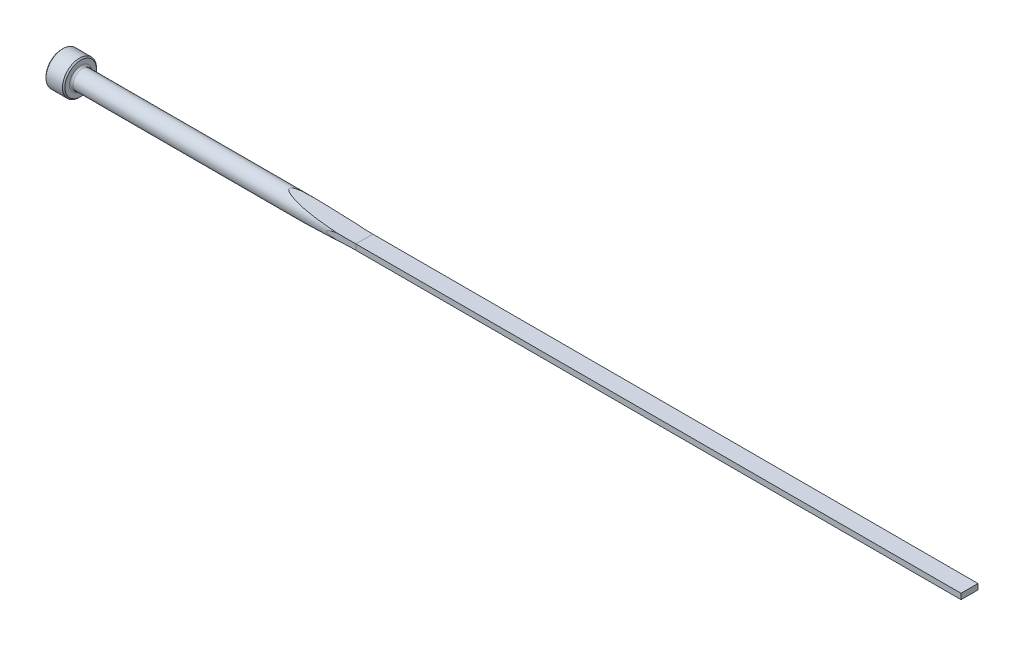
ISO-10303-21;
HEADER;
FILE_DESCRIPTION(('STEP AP214'),'2;1');
FILE_NAME('part.step','',(''),(''),'','','');
FILE_SCHEMA(('AUTOMOTIVE_DESIGN { 1 0 10303 214 1 1 1 1 }'));
ENDSEC;
DATA;
#1=APPLICATION_CONTEXT('core data for automotive mechanical design processes');
#2=APPLICATION_PROTOCOL_DEFINITION('international standard','automotive_design',2000,#1);
#3=PRODUCT_CONTEXT('',#1,'mechanical');
#4=PRODUCT('Part','Part','',(#3));
#5=PRODUCT_RELATED_PRODUCT_CATEGORY('part','',(#4));
#6=PRODUCT_DEFINITION_FORMATION('','',#4);
#7=PRODUCT_DEFINITION_CONTEXT('part definition',#1,'design');
#8=PRODUCT_DEFINITION('design','',#6,#7);
#9=PRODUCT_DEFINITION_SHAPE('','',#8);
#10=(LENGTH_UNIT() NAMED_UNIT(*) SI_UNIT(.MILLI.,.METRE.));
#11=(NAMED_UNIT(*) PLANE_ANGLE_UNIT() SI_UNIT($,.RADIAN.));
#12=(NAMED_UNIT(*) SI_UNIT($,.STERADIAN.) SOLID_ANGLE_UNIT());
#13=UNCERTAINTY_MEASURE_WITH_UNIT(LENGTH_MEASURE(1.E-05),#10,'distance_accuracy_value','');
#14=(GEOMETRIC_REPRESENTATION_CONTEXT(3) GLOBAL_UNCERTAINTY_ASSIGNED_CONTEXT((#13)) GLOBAL_UNIT_ASSIGNED_CONTEXT((#10,
#11,#12)) REPRESENTATION_CONTEXT('',''));
#15=CARTESIAN_POINT('',(0.,0.,0.));
#16=DIRECTION('',(0.,0.,1.));
#17=DIRECTION('',(1.,0.,0.));
#18=AXIS2_PLACEMENT_3D('',#15,#16,#17);
#19=CARTESIAN_POINT('',(0.,0.,0.));
#20=DIRECTION('',(-1.,0.,0.));
#21=DIRECTION('',(0.,0.,1.));
#22=AXIS2_PLACEMENT_3D('',#19,#20,#21);
#23=CYLINDRICAL_SURFACE('',#22,1.9812);
#24=CARTESIAN_POINT('',(4.3434,0.,0.));
#25=DIRECTION('',(-1.,0.,0.));
#26=DIRECTION('',(0.,0.,1.));
#27=AXIS2_PLACEMENT_3D('',#24,#25,#26);
#28=CIRCLE('',#27,1.9812);
#29=CARTESIAN_POINT('',(4.3434,0.,1.9812));
#30=VERTEX_POINT('',#29);
#31=EDGE_CURVE('E152',#30,#30,#28,.F.);
#32=ORIENTED_EDGE('',*,*,#31,.T.);
#33=EDGE_LOOP('',(#32));
#34=FACE_BOUND('',#33,.T.);
#35=CARTESIAN_POINT('',(63.5,0.873996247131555,1.77799999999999));
#36=CARTESIAN_POINT('',(63.3334542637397,0.873989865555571,1.77799993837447));
#37=CARTESIAN_POINT('',(63.1669097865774,0.873044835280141,1.77846802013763));
#38=CARTESIAN_POINT('',(62.8338428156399,0.869223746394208,1.780339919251));
#39=CARTESIAN_POINT('',(62.6673203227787,0.866347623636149,1.78174376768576));
#40=CARTESIAN_POINT('',(62.1674068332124,0.854732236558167,1.78736286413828));
#41=CARTESIAN_POINT('',(61.8340948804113,0.84300568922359,1.7929856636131));
#42=CARTESIAN_POINT('',(61.1727863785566,0.810634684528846,1.80785962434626));
#43=CARTESIAN_POINT('',(60.8447825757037,0.790121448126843,1.81705721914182));
#44=CARTESIAN_POINT('',(60.3536671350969,0.750641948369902,1.83354371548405));
#45=CARTESIAN_POINT('',(60.1901577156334,0.736036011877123,1.83948544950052));
#46=CARTESIAN_POINT('',(59.8635315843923,0.703289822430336,1.85225599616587));
#47=CARTESIAN_POINT('',(59.7004148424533,0.68514985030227,1.85908473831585));
#48=CARTESIAN_POINT('',(59.4296562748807,0.651228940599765,1.87116478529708));
#49=CARTESIAN_POINT('',(59.3218452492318,0.636713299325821,1.8761721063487));
#50=CARTESIAN_POINT('',(59.1065408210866,0.605233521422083,1.88656384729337));
#51=CARTESIAN_POINT('',(58.9990475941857,0.588268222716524,1.8919484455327));
#52=CARTESIAN_POINT('',(58.7835275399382,0.551010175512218,1.9031350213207));
#53=CARTESIAN_POINT('',(58.6755064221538,0.530685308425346,1.90894069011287));
#54=CARTESIAN_POINT('',(58.4604889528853,0.485692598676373,1.92088824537));
#55=CARTESIAN_POINT('',(58.3534914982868,0.461030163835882,1.92702970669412));
#56=CARTESIAN_POINT('',(58.1938896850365,0.418829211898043,1.93647603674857));
#57=CARTESIAN_POINT('',(58.1406123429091,0.403818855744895,1.93967803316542));
#58=CARTESIAN_POINT('',(58.0346066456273,0.371424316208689,1.94614386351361));
#59=CARTESIAN_POINT('',(57.9818801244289,0.354033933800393,1.94940783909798));
#60=CARTESIAN_POINT('',(57.8782386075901,0.31609459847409,1.95591437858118));
#61=CARTESIAN_POINT('',(57.8273101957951,0.295581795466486,1.95915679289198));
#62=CARTESIAN_POINT('',(57.7278405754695,0.249491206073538,1.9655736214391));
#63=CARTESIAN_POINT('',(57.6792877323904,0.223942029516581,1.96874831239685));
#64=CARTESIAN_POINT('',(57.6167619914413,0.181702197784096,1.97288277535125));
#65=CARTESIAN_POINT('',(57.5999648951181,0.16929724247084,1.97399869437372));
#66=CARTESIAN_POINT('',(57.5681376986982,0.142414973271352,1.97612145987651));
#67=CARTESIAN_POINT('',(57.5530993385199,0.12794811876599,1.97712881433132));
#68=CARTESIAN_POINT('',(57.5334076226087,0.104576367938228,1.97845199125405));
#69=CARTESIAN_POINT('',(57.5274666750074,0.0967736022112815,1.97885188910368));
#70=CARTESIAN_POINT('',(57.516621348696,0.0804504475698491,1.97958282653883));
#71=CARTESIAN_POINT('',(57.5117177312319,0.0719295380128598,1.9799138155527));
#72=CARTESIAN_POINT('',(57.5032905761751,0.0540450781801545,1.9804831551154));
#73=CARTESIAN_POINT('',(57.4997893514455,0.0446706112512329,1.98072000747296));
#74=CARTESIAN_POINT('',(57.4947628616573,0.0254116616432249,1.98106017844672));
#75=CARTESIAN_POINT('',(57.4932312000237,0.0155289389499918,1.98116392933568));
#76=CARTESIAN_POINT('',(57.4924621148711,-0.00283989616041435,1.98121601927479));
#77=CARTESIAN_POINT('',(57.4929156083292,-0.0113136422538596,1.98118529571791));
#78=CARTESIAN_POINT('',(57.4953671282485,-0.0280374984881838,1.98101929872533));
#79=CARTESIAN_POINT('',(57.4973672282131,-0.0362872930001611,1.98088388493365));
#80=CARTESIAN_POINT('',(57.5032599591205,-0.0541083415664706,1.98048527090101));
#81=CARTESIAN_POINT('',(57.5074720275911,-0.0635712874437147,1.98020051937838));
#82=CARTESIAN_POINT('',(57.5173271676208,-0.081709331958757,1.97953524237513));
#83=CARTESIAN_POINT('',(57.5229731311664,-0.0903827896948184,1.97915452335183));
#84=CARTESIAN_POINT('',(57.5399709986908,-0.113337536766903,1.97801031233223));
#85=CARTESIAN_POINT('',(57.5523792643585,-0.126821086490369,1.97717711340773));
#86=CARTESIAN_POINT('',(57.578895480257,-0.151968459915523,1.97540307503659));
#87=CARTESIAN_POINT('',(57.5930088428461,-0.163626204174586,1.97446189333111));
#88=CARTESIAN_POINT('',(57.6308983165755,-0.19208509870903,1.97194504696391));
#89=CARTESIAN_POINT('',(57.6554459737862,-0.207842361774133,1.97032379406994));
#90=CARTESIAN_POINT('',(57.7058684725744,-0.237095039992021,1.96701597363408));
#91=CARTESIAN_POINT('',(57.731746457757,-0.250584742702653,1.9653292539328));
#92=CARTESIAN_POINT('',(57.8107777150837,-0.288767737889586,1.96021411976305));
#93=CARTESIAN_POINT('',(57.8650936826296,-0.311024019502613,1.95674636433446));
#94=CARTESIAN_POINT('',(57.9833217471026,-0.354812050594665,1.94931073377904));
#95=CARTESIAN_POINT('',(58.0474477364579,-0.375730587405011,1.94534614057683));
#96=CARTESIAN_POINT('',(58.1766973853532,-0.41429027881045,1.93749827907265));
#97=CARTESIAN_POINT('',(58.2418214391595,-0.431930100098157,1.93361504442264));
#98=CARTESIAN_POINT('',(58.4383860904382,-0.481456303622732,1.92211396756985));
#99=CARTESIAN_POINT('',(58.5707045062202,-0.509845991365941,1.91466459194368));
#100=CARTESIAN_POINT('',(58.8364278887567,-0.560951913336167,1.90030665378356));
#101=CARTESIAN_POINT('',(58.9698330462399,-0.583667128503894,1.89339818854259));
#102=CARTESIAN_POINT('',(59.2371090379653,-0.624985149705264,1.88016424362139));
#103=CARTESIAN_POINT('',(59.3709789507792,-0.643593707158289,1.87383795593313));
#104=CARTESIAN_POINT('',(59.6612886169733,-0.680513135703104,1.86077894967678));
#105=CARTESIAN_POINT('',(59.8178028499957,-0.698266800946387,1.85415178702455));
#106=CARTESIAN_POINT('',(60.1312113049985,-0.730437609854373,1.84171312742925));
#107=CARTESIAN_POINT('',(60.2881055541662,-0.744854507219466,1.83590169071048));
#108=CARTESIAN_POINT('',(60.7593917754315,-0.784010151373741,1.81969752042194));
#109=CARTESIAN_POINT('',(61.074170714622,-0.804628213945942,1.81054467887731));
#110=CARTESIAN_POINT('',(61.703676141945,-0.837438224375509,1.79559337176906));
#111=CARTESIAN_POINT('',(62.0184017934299,-0.849644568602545,1.78978917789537));
#112=CARTESIAN_POINT('',(62.6480072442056,-0.866841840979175,1.78152544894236));
#113=CARTESIAN_POINT('',(62.962886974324,-0.871834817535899,1.77906496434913));
#114=CARTESIAN_POINT('',(63.3518520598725,-0.873806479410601,1.77809255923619));
#115=CARTESIAN_POINT('',(63.4259264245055,-0.873993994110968,1.77799996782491));
#116=CARTESIAN_POINT('',(63.5,-0.873996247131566,1.77799999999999));
#117=B_SPLINE_CURVE_WITH_KNOTS('',3,(#35,#36,#37,#38,#39,#40,#41,#42,#43,#44,#45,#46,#47,#48,
#49,#50,#51,#52,#53,#54,#55,#56,#57,#58,#59,#60,#61,#62,#63,#64,#65,#66,#67,#68,#69,#70,#71,#72,
#73,#74,#75,#76,#77,#78,#79,#80,#81,#82,#83,#84,#85,#86,#87,#88,#89,#90,#91,#92,#93,#94,#95,#96,
#97,#98,#99,#100,#101,#102,#103,#104,#105,#106,#107,#108,#109,#110,#111,#112,#113,#114,#115,
#116),.UNSPECIFIED.,.F.,.F.,(4,2,2,2,2,2,2,2,2,2,2,2,2,2,2,2,2,2,2,2,2,2,2,2,2,2,2,2,2,2,2,2,2,
2,2,2,2,2,2,2,4),(0.,0.499631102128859,0.999278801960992,1.9998489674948,2.98597077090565,
3.47874557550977,3.97148123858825,4.29815737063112,4.62498898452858,4.95514810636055,
5.28489848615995,5.4512016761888,5.61794656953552,5.78289019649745,5.9469225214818,
6.00956538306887,6.07190109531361,6.10128690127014,6.1306941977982,6.1605523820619,
6.1903133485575,6.21561974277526,6.24096012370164,6.27187252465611,6.30284777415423,
6.35756673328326,6.41246418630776,6.49988097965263,6.58751479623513,6.76361391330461,
6.96621737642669,7.16890304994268,7.57526706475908,7.98170400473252,8.38756806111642,
8.86049226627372,9.33345136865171,10.2800238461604,11.2249722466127,12.1696522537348,
12.3918748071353),.UNSPECIFIED.);
#118=CARTESIAN_POINT('',(59.5839311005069,0.670493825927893,1.86429382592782));
#119=VERTEX_POINT('',#118);
#120=CARTESIAN_POINT('',(59.583931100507,-0.67049382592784,1.86429382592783));
#121=VERTEX_POINT('',#120);
#122=EDGE_CURVE('E155',#119,#121,#117,.T.);
#123=ORIENTED_EDGE('',*,*,#122,.F.);
#124=CARTESIAN_POINT('',(63.5,0.584199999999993,1.89310955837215));
#125=CARTESIAN_POINT('',(63.1700863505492,0.584199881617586,1.89309681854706));
#126=CARTESIAN_POINT('',(62.8401724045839,0.58603649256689,1.89254233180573));
#127=CARTESIAN_POINT('',(62.1803800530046,0.593382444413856,1.89025884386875));
#128=CARTESIAN_POINT('',(61.8505016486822,0.598891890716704,1.88852980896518));
#129=CARTESIAN_POINT('',(61.190029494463,0.613600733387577,1.88380042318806));
#130=CARTESIAN_POINT('',(60.8594359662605,0.622809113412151,1.88079697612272));
#131=CARTESIAN_POINT('',(60.1983963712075,0.644913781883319,1.87333307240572));
#132=CARTESIAN_POINT('',(59.867950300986,0.657809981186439,1.86887265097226));
#133=CARTESIAN_POINT('',(59.206638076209,0.687314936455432,1.85822443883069));
#134=CARTESIAN_POINT('',(58.8757722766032,0.703930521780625,1.85203346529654));
#135=CARTESIAN_POINT('',(58.2142925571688,0.74085644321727,1.83757415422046));
#136=CARTESIAN_POINT('',(57.8836786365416,0.761166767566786,1.82930582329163));
#137=CARTESIAN_POINT('',(57.2226843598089,0.805481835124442,1.81023067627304));
#138=CARTESIAN_POINT('',(56.8923040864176,0.829487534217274,1.79942320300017));
#139=CARTESIAN_POINT('',(56.2319511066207,0.881180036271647,1.77468231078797));
#140=CARTESIAN_POINT('',(55.9019783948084,0.908866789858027,1.76074893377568));
#141=CARTESIAN_POINT('',(55.2431418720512,0.96785415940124,1.72902645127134));
#142=CARTESIAN_POINT('',(54.914277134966,0.999148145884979,1.7112443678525));
#143=CARTESIAN_POINT('',(54.2572138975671,1.06536758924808,1.67082431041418));
#144=CARTESIAN_POINT('',(53.9290153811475,1.10029295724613,1.64818645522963));
#145=CARTESIAN_POINT('',(53.2736403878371,1.17372354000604,1.5967269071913));
#146=CARTESIAN_POINT('',(52.9464635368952,1.21222723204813,1.56790783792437));
#147=CARTESIAN_POINT('',(52.2933682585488,1.29276273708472,1.50221251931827));
#148=CARTESIAN_POINT('',(51.967449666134,1.3347940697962,1.46533736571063));
#149=CARTESIAN_POINT('',(51.5099827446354,1.39636103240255,1.40567954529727));
#150=CARTESIAN_POINT('',(51.3776412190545,1.41447635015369,1.38748545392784));
#151=CARTESIAN_POINT('',(51.1133387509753,1.45126058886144,1.34896581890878));
#152=CARTESIAN_POINT('',(50.981377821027,1.46992952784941,1.328640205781));
#153=CARTESIAN_POINT('',(50.7178209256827,1.50781885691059,1.28548073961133));
#154=CARTESIAN_POINT('',(50.5862253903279,1.5270397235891,1.26264466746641));
#155=CARTESIAN_POINT('',(50.3236620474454,1.56598955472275,1.21400299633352));
#156=CARTESIAN_POINT('',(50.1926942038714,1.58571848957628,1.18819757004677));
#157=CARTESIAN_POINT('',(49.9607960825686,1.62117893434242,1.13913600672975));
#158=CARTESIAN_POINT('',(49.8596995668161,1.6368175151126,1.11660072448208));
#159=CARTESIAN_POINT('',(49.658165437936,1.66834712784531,1.0689199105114));
#160=CARTESIAN_POINT('',(49.5577277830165,1.68423814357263,1.0437745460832));
#161=CARTESIAN_POINT('',(49.3579115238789,1.71620155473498,0.990340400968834));
#162=CARTESIAN_POINT('',(49.2585313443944,1.73227357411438,0.962057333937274));
#163=CARTESIAN_POINT('',(49.0610345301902,1.76455408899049,0.901490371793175));
#164=CARTESIAN_POINT('',(48.9629175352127,1.78076254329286,0.869207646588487));
#165=CARTESIAN_POINT('',(48.7875328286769,1.81003279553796,0.806160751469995));
#166=CARTESIAN_POINT('',(48.7099334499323,1.82309131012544,0.776329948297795));
#167=CARTESIAN_POINT('',(48.5563786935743,1.84913700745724,0.712076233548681));
#168=CARTESIAN_POINT('',(48.4804283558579,1.86212389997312,0.677641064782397));
#169=CARTESIAN_POINT('',(48.3308241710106,1.88789942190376,0.602179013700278));
#170=CARTESIAN_POINT('',(48.2571964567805,1.90068529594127,0.561096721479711));
#171=CARTESIAN_POINT('',(48.1513685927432,1.91919096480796,0.492350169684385));
#172=CARTESIAN_POINT('',(48.1169057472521,1.92523948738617,0.468285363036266));
#173=CARTESIAN_POINT('',(48.0502753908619,1.93697192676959,0.417116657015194));
#174=CARTESIAN_POINT('',(48.0181042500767,1.94265641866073,0.390017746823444));
#175=CARTESIAN_POINT('',(47.9629838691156,1.95242426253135,0.337299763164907));
#176=CARTESIAN_POINT('',(47.9394311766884,1.95660898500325,0.312339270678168));
#177=CARTESIAN_POINT('',(47.8960045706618,1.96434049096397,0.259297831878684));
#178=CARTESIAN_POINT('',(47.8761211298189,1.9678889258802,0.231225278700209));
#179=CARTESIAN_POINT('',(47.847884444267,1.97293551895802,0.181839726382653));
#180=CARTESIAN_POINT('',(47.8379127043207,1.97471998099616,0.161493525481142));
#181=CARTESIAN_POINT('',(47.8212302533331,1.97770737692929,0.119454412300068));
#182=CARTESIAN_POINT('',(47.8145156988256,1.97891099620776,0.0977631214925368));
#183=CARTESIAN_POINT('',(47.805038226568,1.9806103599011,0.0532481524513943));
#184=CARTESIAN_POINT('',(47.8023158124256,1.98109884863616,0.0304152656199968));
#185=CARTESIAN_POINT('',(47.8013478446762,1.98127249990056,-0.0153468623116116));
#186=CARTESIAN_POINT('',(47.8031008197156,1.98095792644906,-0.0382760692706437));
#187=CARTESIAN_POINT('',(47.8103218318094,1.97966292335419,-0.080483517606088));
#188=CARTESIAN_POINT('',(47.8152881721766,1.97877241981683,-0.0998547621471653));
#189=CARTESIAN_POINT('',(47.8279513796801,1.97650357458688,-0.137643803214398));
#190=CARTESIAN_POINT('',(47.8356499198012,1.9751249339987,-0.156061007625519));
#191=CARTESIAN_POINT('',(47.8589604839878,1.97095473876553,-0.203392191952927));
#192=CARTESIAN_POINT('',(47.8764622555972,1.96782751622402,-0.231338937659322));
#193=CARTESIAN_POINT('',(47.9153978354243,1.96088554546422,-0.284245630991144));
#194=CARTESIAN_POINT('',(47.9368445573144,1.95706854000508,-0.30919531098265));
#195=CARTESIAN_POINT('',(48.0046826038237,1.94502473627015,-0.379909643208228));
#196=CARTESIAN_POINT('',(48.0548087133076,1.93616258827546,-0.421925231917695));
#197=CARTESIAN_POINT('',(48.1598403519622,1.91769727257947,-0.499149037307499));
#198=CARTESIAN_POINT('',(48.2147605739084,1.90809183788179,-0.534335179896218));
#199=CARTESIAN_POINT('',(48.3216449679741,1.88950738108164,-0.596534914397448));
#200=CARTESIAN_POINT('',(48.3733462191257,1.88056327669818,-0.62401516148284));
#201=CARTESIAN_POINT('',(48.4782240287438,1.86251839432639,-0.675966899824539));
#202=CARTESIAN_POINT('',(48.531401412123,1.85341752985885,-0.700436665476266));
#203=CARTESIAN_POINT('',(48.6926568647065,1.82597467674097,-0.770393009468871));
#204=CARTESIAN_POINT('',(48.8022561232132,1.80752762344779,-0.81231702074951));
#205=CARTESIAN_POINT('',(49.0242156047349,1.77060682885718,-0.889907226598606));
#206=CARTESIAN_POINT('',(49.1365872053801,1.7521334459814,-0.925539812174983));
#207=CARTESIAN_POINT('',(49.3626192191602,1.71542676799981,-0.991916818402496));
#208=CARTESIAN_POINT('',(49.476277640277,1.6971931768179,-1.02266791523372));
#209=CARTESIAN_POINT('',(49.7276664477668,1.65736960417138,-1.08625828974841));
#210=CARTESIAN_POINT('',(49.8656164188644,1.63584659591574,-1.11826213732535));
#211=CARTESIAN_POINT('',(50.1425123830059,1.59331791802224,-1.17806325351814));
#212=CARTESIAN_POINT('',(50.2814585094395,1.57231231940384,-1.205859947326));
#213=CARTESIAN_POINT('',(50.5601420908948,1.53086047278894,-1.25806626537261));
#214=CARTESIAN_POINT('',(50.6998799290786,1.51041452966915,-1.28247407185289));
#215=CARTESIAN_POINT('',(50.9799089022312,1.4701253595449,-1.32846363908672));
#216=CARTESIAN_POINT('',(51.1202000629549,1.4502821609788,-1.3500452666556));
#217=CARTESIAN_POINT('',(51.542381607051,1.39159980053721,-1.41132142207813));
#218=CARTESIAN_POINT('',(51.8249250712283,1.35370535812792,-1.44742925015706));
#219=CARTESIAN_POINT('',(52.3910603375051,1.28055535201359,-1.51251741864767));
#220=CARTESIAN_POINT('',(52.674651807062,1.24529901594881,-1.54149985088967));
#221=CARTESIAN_POINT('',(53.2425168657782,1.17748584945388,-1.59389920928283));
#222=CARTESIAN_POINT('',(53.5267900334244,1.14492765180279,-1.61731896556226));
#223=CARTESIAN_POINT('',(54.0959784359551,1.0825237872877,-1.65973365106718));
#224=CARTESIAN_POINT('',(54.3808937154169,1.05267831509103,-1.67872826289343));
#225=CARTESIAN_POINT('',(54.9508509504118,0.995760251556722,-1.71310209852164));
#226=CARTESIAN_POINT('',(55.2358922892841,0.96868419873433,-1.72848586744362));
#227=CARTESIAN_POINT('',(55.806367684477,0.917275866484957,-1.75630514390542));
#228=CARTESIAN_POINT('',(56.0918017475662,0.892943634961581,-1.76874059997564));
#229=CARTESIAN_POINT('',(56.9571823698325,0.823386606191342,-1.80275032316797));
#230=CARTESIAN_POINT('',(57.5376286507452,0.782459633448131,-1.82054304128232));
#231=CARTESIAN_POINT('',(58.6995565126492,0.711993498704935,-1.84922855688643));
#232=CARTESIAN_POINT('',(59.2810383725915,0.682458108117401,-1.86011907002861));
#233=CARTESIAN_POINT('',(60.4438467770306,0.634843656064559,-1.87690244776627));
#234=CARTESIAN_POINT('',(61.0251726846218,0.616751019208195,-1.8828012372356));
#235=CARTESIAN_POINT('',(62.1880894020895,0.591978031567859,-1.890736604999));
#236=CARTESIAN_POINT('',(62.7696802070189,0.585297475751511,-1.89277325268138));
#237=CARTESIAN_POINT('',(63.4008442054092,0.584241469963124,-1.893096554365));
#238=CARTESIAN_POINT('',(63.4504221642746,0.584199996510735,-1.8931093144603));
#239=CARTESIAN_POINT('',(63.5,0.584199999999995,-1.89310955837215));
#240=B_SPLINE_CURVE_WITH_KNOTS('',3,(#124,#125,#126,#127,#128,#129,#130,#131,#132,#133,#134,
#135,#136,#137,#138,#139,#140,#141,#142,#143,#144,#145,#146,#147,#148,#149,#150,#151,#152,#153,
#154,#155,#156,#157,#158,#159,#160,#161,#162,#163,#164,#165,#166,#167,#168,#169,#170,#171,#172,
#173,#174,#175,#176,#177,#178,#179,#180,#181,#182,#183,#184,#185,#186,#187,#188,#189,#190,#191,
#192,#193,#194,#195,#196,#197,#198,#199,#200,#201,#202,#203,#204,#205,#206,#207,#208,#209,#210,
#211,#212,#213,#214,#215,#216,#217,#218,#219,#220,#221,#222,#223,#224,#225,#226,#227,#228,#229,
#230,#231,#232,#233,#234,#235,#236,#237,#238,#239),.UNSPECIFIED.,.F.,.F.,(4,2,2,2,2,2,2,2,2,2,2,
2,2,2,2,2,2,2,2,2,2,2,2,2,2,2,2,2,2,2,2,2,2,2,2,2,2,2,2,2,2,2,2,2,2,2,2,2,2,2,2,2,2,2,2,2,2,4),
(0.,0.989735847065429,1.97950009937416,2.97168288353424,3.96384168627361,4.95783740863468,
5.95182996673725,6.94608007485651,7.94031684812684,8.9327546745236,9.9251682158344,
10.9171613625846,11.9090196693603,12.3134324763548,12.7178584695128,13.1226448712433,
13.5274077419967,13.841634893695,14.1558419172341,14.4694858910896,14.7830383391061,
15.0353933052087,15.2884339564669,15.5437043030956,15.6709904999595,15.7980703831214,
15.9015679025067,16.0047927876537,16.072755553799,16.1406379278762,16.2092043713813,
16.2777482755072,16.3375605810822,16.3974095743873,16.4961998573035,16.5953194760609,
16.7922291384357,16.9897650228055,17.1673196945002,17.3449756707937,17.7009826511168,
18.0588373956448,18.4161984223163,18.8458318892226,19.2755240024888,19.7054457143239,
20.1353876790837,20.9972882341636,21.8589354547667,22.7201433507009,23.5814129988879,
24.4415926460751,25.3017873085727,27.0480737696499,28.7949378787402,30.539725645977,
32.2844820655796,32.4332159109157),.UNSPECIFIED.);
#241=CARTESIAN_POINT('',(59.5839311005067,0.670493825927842,-1.86429382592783));
#242=VERTEX_POINT('',#241);
#243=EDGE_CURVE('E105',#119,#242,#240,.T.);
#244=ORIENTED_EDGE('',*,*,#243,.T.);
#245=CARTESIAN_POINT('',(63.5,0.873996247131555,-1.77799999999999));
#246=CARTESIAN_POINT('',(63.3334542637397,0.873989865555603,-1.77799993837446));
#247=CARTESIAN_POINT('',(63.1669097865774,0.873044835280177,-1.77846802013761));
#248=CARTESIAN_POINT('',(62.8338428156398,0.869223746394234,-1.78033991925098));
#249=CARTESIAN_POINT('',(62.6673203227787,0.86634762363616,-1.78174376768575));
#250=CARTESIAN_POINT('',(62.1674068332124,0.854732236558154,-1.78736286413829));
#251=CARTESIAN_POINT('',(61.8340948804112,0.843005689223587,-1.7929856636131));
#252=CARTESIAN_POINT('',(61.1727863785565,0.81063468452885,-1.80785962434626));
#253=CARTESIAN_POINT('',(60.8447825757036,0.790121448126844,-1.81705721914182));
#254=CARTESIAN_POINT('',(60.3536671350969,0.750641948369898,-1.83354371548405));
#255=CARTESIAN_POINT('',(60.1901577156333,0.736036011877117,-1.83948544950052));
#256=CARTESIAN_POINT('',(59.8635315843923,0.703289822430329,-1.85225599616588));
#257=CARTESIAN_POINT('',(59.7004148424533,0.685149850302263,-1.85908473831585));
#258=CARTESIAN_POINT('',(59.4296562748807,0.651228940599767,-1.87116478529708));
#259=CARTESIAN_POINT('',(59.3218452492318,0.63671329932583,-1.8761721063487));
#260=CARTESIAN_POINT('',(59.1065408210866,0.605233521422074,-1.88656384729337));
#261=CARTESIAN_POINT('',(58.9990475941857,0.588268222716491,-1.89194844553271));
#262=CARTESIAN_POINT('',(58.7835275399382,0.551010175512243,-1.9031350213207));
#263=CARTESIAN_POINT('',(58.6755064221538,0.530685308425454,-1.90894069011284));
#264=CARTESIAN_POINT('',(58.4604889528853,0.485692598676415,-1.92088824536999));
#265=CARTESIAN_POINT('',(58.3534914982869,0.461030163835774,-1.92702970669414));
#266=CARTESIAN_POINT('',(58.1938896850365,0.418829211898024,-1.93647603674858));
#267=CARTESIAN_POINT('',(58.1406123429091,0.403818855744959,-1.93967803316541));
#268=CARTESIAN_POINT('',(58.0346066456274,0.37142431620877,-1.9461438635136));
#269=CARTESIAN_POINT('',(57.981880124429,0.354033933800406,-1.94940783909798));
#270=CARTESIAN_POINT('',(57.8782386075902,0.316094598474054,-1.95591437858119));
#271=CARTESIAN_POINT('',(57.8273101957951,0.295581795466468,-1.95915679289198));
#272=CARTESIAN_POINT('',(57.7278405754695,0.249491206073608,-1.96557362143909));
#273=CARTESIAN_POINT('',(57.6792877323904,0.223942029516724,-1.96874831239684));
#274=CARTESIAN_POINT('',(57.6167619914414,0.18170219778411,-1.97288277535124));
#275=CARTESIAN_POINT('',(57.5999648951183,0.169297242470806,-1.97399869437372));
#276=CARTESIAN_POINT('',(57.5681376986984,0.142414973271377,-1.97612145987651));
#277=CARTESIAN_POINT('',(57.55309933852,0.12794811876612,-1.97712881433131));
#278=CARTESIAN_POINT('',(57.5334076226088,0.104576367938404,-1.97845199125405));
#279=CARTESIAN_POINT('',(57.5274666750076,0.096773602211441,-1.97885188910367));
#280=CARTESIAN_POINT('',(57.5166213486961,0.0804504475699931,-1.97958282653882));
#281=CARTESIAN_POINT('',(57.5117177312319,0.0719295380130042,-1.9799138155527));
#282=CARTESIAN_POINT('',(57.5032905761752,0.0540450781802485,-1.9804831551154));
#283=CARTESIAN_POINT('',(57.4997893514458,0.0446706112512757,-1.98072000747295));
#284=CARTESIAN_POINT('',(57.4947628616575,0.0254116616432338,-1.98106017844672));
#285=CARTESIAN_POINT('',(57.4932312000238,0.015528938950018,-1.98116392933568));
#286=CARTESIAN_POINT('',(57.4924621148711,-0.00283989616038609,-1.98121601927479));
#287=CARTESIAN_POINT('',(57.4929156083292,-0.0113136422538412,-1.98118529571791));
#288=CARTESIAN_POINT('',(57.4953671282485,-0.0280374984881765,-1.98101929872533));
#289=CARTESIAN_POINT('',(57.4973672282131,-0.0362872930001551,-1.98088388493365));
#290=CARTESIAN_POINT('',(57.5032599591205,-0.0541083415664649,-1.98048527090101));
#291=CARTESIAN_POINT('',(57.5074720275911,-0.0635712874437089,-1.98020051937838));
#292=CARTESIAN_POINT('',(57.5173271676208,-0.0817093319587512,-1.97953524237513));
#293=CARTESIAN_POINT('',(57.5229731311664,-0.0903827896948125,-1.97915452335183));
#294=CARTESIAN_POINT('',(57.5399709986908,-0.1133375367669,-1.97801031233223));
#295=CARTESIAN_POINT('',(57.5523792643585,-0.126821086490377,-1.97717711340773));
#296=CARTESIAN_POINT('',(57.578895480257,-0.151968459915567,-1.97540307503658));
#297=CARTESIAN_POINT('',(57.593008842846,-0.163626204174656,-1.9744618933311));
#298=CARTESIAN_POINT('',(57.6308983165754,-0.192085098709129,-1.9719450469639));
#299=CARTESIAN_POINT('',(57.6554459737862,-0.207842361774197,-1.97032379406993));
#300=CARTESIAN_POINT('',(57.7058684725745,-0.23709503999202,-1.96701597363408));
#301=CARTESIAN_POINT('',(57.7317464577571,-0.250584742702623,-1.96532925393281));
#302=CARTESIAN_POINT('',(57.8107777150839,-0.288767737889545,-1.96021411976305));
#303=CARTESIAN_POINT('',(57.8650936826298,-0.311024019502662,-1.95674636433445));
#304=CARTESIAN_POINT('',(57.983321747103,-0.354812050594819,-1.94931073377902));
#305=CARTESIAN_POINT('',(58.0474477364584,-0.375730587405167,-1.9453461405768));
#306=CARTESIAN_POINT('',(58.1766973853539,-0.414290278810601,-1.93749827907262));
#307=CARTESIAN_POINT('',(58.2418214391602,-0.431930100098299,-1.93361504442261));
#308=CARTESIAN_POINT('',(58.4383860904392,-0.481456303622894,-1.92211396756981));
#309=CARTESIAN_POINT('',(58.5707045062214,-0.509845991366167,-1.91466459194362));
#310=CARTESIAN_POINT('',(58.8364278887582,-0.560951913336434,-1.90030665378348));
#311=CARTESIAN_POINT('',(58.9698330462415,-0.583667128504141,-1.89339818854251));
#312=CARTESIAN_POINT('',(59.2371090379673,-0.624985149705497,-1.88016424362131));
#313=CARTESIAN_POINT('',(59.3709789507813,-0.64359370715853,-1.87383795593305));
#314=CARTESIAN_POINT('',(59.6612886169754,-0.680513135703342,-1.86077894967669));
#315=CARTESIAN_POINT('',(59.8178028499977,-0.698266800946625,-1.85415178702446));
#316=CARTESIAN_POINT('',(60.1312113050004,-0.730437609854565,-1.84171312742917));
#317=CARTESIAN_POINT('',(60.288105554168,-0.744854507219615,-1.83590169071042));
#318=CARTESIAN_POINT('',(60.759391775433,-0.7840101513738,-1.81969752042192));
#319=CARTESIAN_POINT('',(61.0741707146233,-0.804628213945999,-1.81054467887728));
#320=CARTESIAN_POINT('',(61.7036761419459,-0.837438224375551,-1.79559337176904));
#321=CARTESIAN_POINT('',(62.0184017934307,-0.849644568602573,-1.78978917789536));
#322=CARTESIAN_POINT('',(62.6480072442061,-0.866841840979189,-1.78152544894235));
#323=CARTESIAN_POINT('',(62.9628869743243,-0.871834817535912,-1.77906496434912));
#324=CARTESIAN_POINT('',(63.3518520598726,-0.87380647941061,-1.77809255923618));
#325=CARTESIAN_POINT('',(63.4259264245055,-0.873993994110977,-1.7779999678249));
#326=CARTESIAN_POINT('',(63.5,-0.873996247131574,-1.77799999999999));
#327=B_SPLINE_CURVE_WITH_KNOTS('',3,(#245,#246,#247,#248,#249,#250,#251,#252,#253,#254,#255,
#256,#257,#258,#259,#260,#261,#262,#263,#264,#265,#266,#267,#268,#269,#270,#271,#272,#273,#274,
#275,#276,#277,#278,#279,#280,#281,#282,#283,#284,#285,#286,#287,#288,#289,#290,#291,#292,#293,
#294,#295,#296,#297,#298,#299,#300,#301,#302,#303,#304,#305,#306,#307,#308,#309,#310,#311,#312,
#313,#314,#315,#316,#317,#318,#319,#320,#321,#322,#323,#324,#325,#326),.UNSPECIFIED.,.F.,.F.,(4,
2,2,2,2,2,2,2,2,2,2,2,2,2,2,2,2,2,2,2,2,2,2,2,2,2,2,2,2,2,2,2,2,2,2,2,2,2,2,2,4),(0.,
0.499631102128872,0.99927880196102,1.99984896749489,2.98597077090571,3.4787455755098,
3.97148123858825,4.2981573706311,4.62498898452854,4.95514810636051,5.28489848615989,
5.45120167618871,5.61794656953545,5.7828901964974,5.94692252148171,6.00956538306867,
6.07190109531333,6.1012869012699,6.13069419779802,6.16055238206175,6.19031334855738,
6.21561974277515,6.24096012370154,6.27187252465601,6.30284777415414,6.35756673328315,
6.41246418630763,6.49988097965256,6.58751479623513,6.7636139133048,6.96621737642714,
7.16890304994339,7.57526706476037,7.98170400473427,8.38756806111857,8.86049226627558,
9.33345136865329,10.2800238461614,11.2249722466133,12.1696522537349,12.3918748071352),.UNSPECIFIED.);
#328=CARTESIAN_POINT('',(59.583931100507,-0.67049382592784,-1.86429382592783));
#329=VERTEX_POINT('',#328);
#330=EDGE_CURVE('E174',#242,#329,#327,.T.);
#331=ORIENTED_EDGE('',*,*,#330,.T.);
#332=CARTESIAN_POINT('',(63.5,-0.584199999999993,1.89310955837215));
#333=CARTESIAN_POINT('',(63.1700863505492,-0.584199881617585,1.89309681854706));
#334=CARTESIAN_POINT('',(62.840172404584,-0.586036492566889,1.89254233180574));
#335=CARTESIAN_POINT('',(62.1803800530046,-0.593382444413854,1.89025884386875));
#336=CARTESIAN_POINT('',(61.8505016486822,-0.598891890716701,1.88852980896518));
#337=CARTESIAN_POINT('',(61.190029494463,-0.613600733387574,1.88380042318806));
#338=CARTESIAN_POINT('',(60.8594359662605,-0.622809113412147,1.88079697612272));
#339=CARTESIAN_POINT('',(60.1983963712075,-0.644913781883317,1.87333307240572));
#340=CARTESIAN_POINT('',(59.867950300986,-0.657809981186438,1.86887265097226));
#341=CARTESIAN_POINT('',(59.206638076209,-0.687314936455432,1.8582244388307));
#342=CARTESIAN_POINT('',(58.8757722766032,-0.703930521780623,1.85203346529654));
#343=CARTESIAN_POINT('',(58.2142925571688,-0.740856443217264,1.83757415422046));
#344=CARTESIAN_POINT('',(57.8836786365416,-0.761166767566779,1.82930582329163));
#345=CARTESIAN_POINT('',(57.2226843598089,-0.805481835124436,1.81023067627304));
#346=CARTESIAN_POINT('',(56.8923040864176,-0.829487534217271,1.79942320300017));
#347=CARTESIAN_POINT('',(56.2319511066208,-0.88118003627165,1.77468231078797));
#348=CARTESIAN_POINT('',(55.9019783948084,-0.908866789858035,1.76074893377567));
#349=CARTESIAN_POINT('',(55.2431418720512,-0.967854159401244,1.72902645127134));
#350=CARTESIAN_POINT('',(54.914277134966,-0.999148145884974,1.7112443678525));
#351=CARTESIAN_POINT('',(54.2572138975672,-1.06536758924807,1.67082431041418));
#352=CARTESIAN_POINT('',(53.9290153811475,-1.10029295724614,1.64818645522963));
#353=CARTESIAN_POINT('',(53.2736403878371,-1.17372354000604,1.59672690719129));
#354=CARTESIAN_POINT('',(52.9464635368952,-1.21222723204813,1.56790783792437));
#355=CARTESIAN_POINT('',(52.2933682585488,-1.29276273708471,1.50221251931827));
#356=CARTESIAN_POINT('',(51.967449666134,-1.33479406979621,1.46533736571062));
#357=CARTESIAN_POINT('',(51.5099827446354,-1.39636103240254,1.40567954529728));
#358=CARTESIAN_POINT('',(51.3776412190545,-1.41447635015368,1.38748545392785));
#359=CARTESIAN_POINT('',(51.1133387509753,-1.45126058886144,1.34896581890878));
#360=CARTESIAN_POINT('',(50.981377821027,-1.46992952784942,1.32864020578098));
#361=CARTESIAN_POINT('',(50.7178209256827,-1.5078188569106,1.28548073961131));
#362=CARTESIAN_POINT('',(50.5862253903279,-1.5270397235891,1.26264466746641));
#363=CARTESIAN_POINT('',(50.3236620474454,-1.56598955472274,1.21400299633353));
#364=CARTESIAN_POINT('',(50.1926942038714,-1.58571848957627,1.18819757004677));
#365=CARTESIAN_POINT('',(49.9607960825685,-1.62117893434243,1.13913600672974));
#366=CARTESIAN_POINT('',(49.8596995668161,-1.63681751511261,1.11660072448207));
#367=CARTESIAN_POINT('',(49.658165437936,-1.66834712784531,1.06891991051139));
#368=CARTESIAN_POINT('',(49.5577277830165,-1.68423814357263,1.04377454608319));
#369=CARTESIAN_POINT('',(49.3579115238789,-1.71620155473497,0.990340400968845));
#370=CARTESIAN_POINT('',(49.2585313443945,-1.73227357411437,0.962057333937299));
#371=CARTESIAN_POINT('',(49.0610345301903,-1.76455408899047,0.901490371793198));
#372=CARTESIAN_POINT('',(48.9629175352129,-1.78076254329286,0.869207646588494));
#373=CARTESIAN_POINT('',(48.787532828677,-1.81003279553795,0.806160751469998));
#374=CARTESIAN_POINT('',(48.7099334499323,-1.82309131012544,0.776329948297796));
#375=CARTESIAN_POINT('',(48.5563786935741,-1.84913700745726,0.712076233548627));
#376=CARTESIAN_POINT('',(48.4804283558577,-1.86212389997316,0.677641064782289));
#377=CARTESIAN_POINT('',(48.3308241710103,-1.88789942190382,0.602179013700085));
#378=CARTESIAN_POINT('',(48.2571964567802,-1.90068529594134,0.561096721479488));
#379=CARTESIAN_POINT('',(48.1513685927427,-1.91919096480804,0.492350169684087));
#380=CARTESIAN_POINT('',(48.1169057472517,-1.92523948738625,0.46828536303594));
#381=CARTESIAN_POINT('',(48.0502753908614,-1.93697192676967,0.417116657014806));
#382=CARTESIAN_POINT('',(48.0181042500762,-1.94265641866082,0.390017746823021));
#383=CARTESIAN_POINT('',(47.9629838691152,-1.95242426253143,0.337299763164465));
#384=CARTESIAN_POINT('',(47.939431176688,-1.95660898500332,0.312339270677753));
#385=CARTESIAN_POINT('',(47.8960045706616,-1.96434049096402,0.259297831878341));
#386=CARTESIAN_POINT('',(47.8761211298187,-1.96788892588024,0.23122527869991));
#387=CARTESIAN_POINT('',(47.8478844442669,-1.97293551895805,0.181839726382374));
#388=CARTESIAN_POINT('',(47.8379127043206,-1.97471998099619,0.161493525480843));
#389=CARTESIAN_POINT('',(47.8212302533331,-1.97770737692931,0.119454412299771));
#390=CARTESIAN_POINT('',(47.8145156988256,-1.97891099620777,0.0977631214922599));
#391=CARTESIAN_POINT('',(47.8050382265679,-1.9806103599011,0.0532481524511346));
#392=CARTESIAN_POINT('',(47.8023158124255,-1.98109884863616,0.0304152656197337));
#393=CARTESIAN_POINT('',(47.8013478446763,-1.98127249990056,-0.0153468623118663));
#394=CARTESIAN_POINT('',(47.8031008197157,-1.98095792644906,-0.0382760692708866));
#395=CARTESIAN_POINT('',(47.8103218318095,-1.97966292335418,-0.0804835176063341));
#396=CARTESIAN_POINT('',(47.8152881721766,-1.97877241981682,-0.0998547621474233));
#397=CARTESIAN_POINT('',(47.8279513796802,-1.97650357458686,-0.137643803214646));
#398=CARTESIAN_POINT('',(47.8356499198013,-1.97512493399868,-0.156061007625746));
#399=CARTESIAN_POINT('',(47.858960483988,-1.97095473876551,-0.203392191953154));
#400=CARTESIAN_POINT('',(47.8764622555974,-1.96782751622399,-0.231338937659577));
#401=CARTESIAN_POINT('',(47.9153978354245,-1.96088554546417,-0.28424563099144));
#402=CARTESIAN_POINT('',(47.9368445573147,-1.95706854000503,-0.309195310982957));
#403=CARTESIAN_POINT('',(48.0046826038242,-1.94502473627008,-0.379909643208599));
#404=CARTESIAN_POINT('',(48.0548087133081,-1.93616258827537,-0.421925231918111));
#405=CARTESIAN_POINT('',(48.159840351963,-1.91769727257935,-0.499149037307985));
#406=CARTESIAN_POINT('',(48.2147605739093,-1.90809183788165,-0.534335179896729));
#407=CARTESIAN_POINT('',(48.3216449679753,-1.88950738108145,-0.596534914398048));
#408=CARTESIAN_POINT('',(48.3733462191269,-1.88056327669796,-0.6240151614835));
#409=CARTESIAN_POINT('',(48.4782240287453,-1.86251839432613,-0.67596689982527));
#410=CARTESIAN_POINT('',(48.5314014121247,-1.85341752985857,-0.700436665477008));
#411=CARTESIAN_POINT('',(48.6926568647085,-1.82597467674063,-0.770393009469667));
#412=CARTESIAN_POINT('',(48.8022561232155,-1.80752762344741,-0.812317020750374));
#413=CARTESIAN_POINT('',(49.0242156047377,-1.77060682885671,-0.889907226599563));
#414=CARTESIAN_POINT('',(49.1365872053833,-1.75213344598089,-0.925539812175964));
#415=CARTESIAN_POINT('',(49.3626192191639,-1.71542676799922,-0.991916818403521));
#416=CARTESIAN_POINT('',(49.476277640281,-1.69719317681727,-1.02266791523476));
#417=CARTESIAN_POINT('',(49.7276664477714,-1.65736960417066,-1.08625828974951));
#418=CARTESIAN_POINT('',(49.8656164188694,-1.63584659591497,-1.11826213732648));
#419=CARTESIAN_POINT('',(50.1425123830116,-1.59331791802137,-1.17806325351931));
#420=CARTESIAN_POINT('',(50.2814585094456,-1.57231231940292,-1.2058599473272));
#421=CARTESIAN_POINT('',(50.5601420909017,-1.53086047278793,-1.25806626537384));
#422=CARTESIAN_POINT('',(50.6998799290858,-1.5104145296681,-1.28247407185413));
#423=CARTESIAN_POINT('',(50.9799089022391,-1.47012535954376,-1.32846363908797));
#424=CARTESIAN_POINT('',(51.1202000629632,-1.45028216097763,-1.35004526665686));
#425=CARTESIAN_POINT('',(51.5423816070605,-1.39159980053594,-1.41132142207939));
#426=CARTESIAN_POINT('',(51.8249250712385,-1.35370535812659,-1.4474292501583));
#427=CARTESIAN_POINT('',(52.3910603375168,-1.28055535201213,-1.5125174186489));
#428=CARTESIAN_POINT('',(52.6746518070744,-1.24529901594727,-1.54149985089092));
#429=CARTESIAN_POINT('',(53.2425168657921,-1.17748584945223,-1.59389920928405));
#430=CARTESIAN_POINT('',(53.5267900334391,-1.14492765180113,-1.61731896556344));
#431=CARTESIAN_POINT('',(54.0959784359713,-1.08252378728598,-1.6597336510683));
#432=CARTESIAN_POINT('',(54.3808937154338,-1.05267831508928,-1.67872826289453));
#433=CARTESIAN_POINT('',(54.9508509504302,-0.99576025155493,-1.71310209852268));
#434=CARTESIAN_POINT('',(55.2358922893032,-0.968684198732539,-1.72848586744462));
#435=CARTESIAN_POINT('',(55.8063676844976,-0.917275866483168,-1.75630514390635));
#436=CARTESIAN_POINT('',(56.0918017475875,-0.892943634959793,-1.76874059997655));
#437=CARTESIAN_POINT('',(56.9571823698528,-0.823386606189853,-1.80275032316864));
#438=CARTESIAN_POINT('',(57.5376286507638,-0.782459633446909,-1.82054304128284));
#439=CARTESIAN_POINT('',(58.6995565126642,-0.711993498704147,-1.84922855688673));
#440=CARTESIAN_POINT('',(59.2810383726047,-0.682458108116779,-1.86011907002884));
#441=CARTESIAN_POINT('',(60.4438467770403,-0.634843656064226,-1.87690244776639));
#442=CARTESIAN_POINT('',(61.0251726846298,-0.616751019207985,-1.88280123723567));
#443=CARTESIAN_POINT('',(62.1880894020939,-0.591978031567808,-1.89073660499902));
#444=CARTESIAN_POINT('',(62.7696802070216,-0.585297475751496,-1.89277325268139));
#445=CARTESIAN_POINT('',(63.4008442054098,-0.584241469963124,-1.893096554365));
#446=CARTESIAN_POINT('',(63.4504221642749,-0.584199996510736,-1.8931093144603));
#447=CARTESIAN_POINT('',(63.5,-0.584199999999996,-1.89310955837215));
#448=B_SPLINE_CURVE_WITH_KNOTS('',3,(#332,#333,#334,#335,#336,#337,#338,#339,#340,#341,#342,
#343,#344,#345,#346,#347,#348,#349,#350,#351,#352,#353,#354,#355,#356,#357,#358,#359,#360,#361,
#362,#363,#364,#365,#366,#367,#368,#369,#370,#371,#372,#373,#374,#375,#376,#377,#378,#379,#380,
#381,#382,#383,#384,#385,#386,#387,#388,#389,#390,#391,#392,#393,#394,#395,#396,#397,#398,#399,
#400,#401,#402,#403,#404,#405,#406,#407,#408,#409,#410,#411,#412,#413,#414,#415,#416,#417,#418,
#419,#420,#421,#422,#423,#424,#425,#426,#427,#428,#429,#430,#431,#432,#433,#434,#435,#436,#437,
#438,#439,#440,#441,#442,#443,#444,#445,#446,#447),.UNSPECIFIED.,.F.,.F.,(4,2,2,2,2,2,2,2,2,2,2,
2,2,2,2,2,2,2,2,2,2,2,2,2,2,2,2,2,2,2,2,2,2,2,2,2,2,2,2,2,2,2,2,2,2,2,2,2,2,2,2,2,2,2,2,2,2,4),
(0.,0.989735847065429,1.97950009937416,2.97168288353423,3.96384168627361,4.95783740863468,
5.95182996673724,6.94608007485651,7.94031684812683,8.93275467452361,9.92516821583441,
10.9171613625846,11.9090196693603,12.3134324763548,12.7178584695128,13.1226448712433,
13.5274077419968,13.841634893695,14.155841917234,14.4694858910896,14.783038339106,
15.0353933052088,15.2884339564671,15.5437043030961,15.6709904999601,15.7980703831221,
15.9015679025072,16.004792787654,16.0727555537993,16.1406379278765,16.2092043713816,
16.2777482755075,16.3375605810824,16.3974095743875,16.4961998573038,16.5953194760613,
16.7922291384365,16.9897650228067,17.1673196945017,17.3449756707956,17.7009826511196,
18.0588373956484,18.4161984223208,18.8458318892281,19.2755240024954,19.7054457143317,
20.1353876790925,20.9972882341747,21.85893545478,22.7201433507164,23.5814129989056,
24.4415926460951,25.3017873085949,27.0480737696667,28.7949378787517,30.5397256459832,
32.2844820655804,32.4332159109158),.UNSPECIFIED.);
#449=EDGE_CURVE('E104',#121,#329,#448,.T.);
#450=ORIENTED_EDGE('',*,*,#449,.F.);
#451=EDGE_LOOP('',(#123,#244,#331,#450));
#452=FACE_BOUND('',#451,.T.);
#453=ADVANCED_FACE('F32',(#34,#452),#23,.T.);
#454=CARTESIAN_POINT('',(190.5,1.9812,0.));
#455=DIRECTION('',(-1.,0.,0.));
#456=DIRECTION('',(0.,0.,1.));
#457=AXIS2_PLACEMENT_3D('',#454,#455,#456);
#458=PLANE('',#457);
#459=DIRECTION('',(0.,1.,0.));
#460=VECTOR('',#459,1.);
#461=CARTESIAN_POINT('',(190.5,-3.5687,1.778));
#462=LINE('',#461,#460);
#463=CARTESIAN_POINT('',(190.5,-0.584200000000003,1.778));
#464=VERTEX_POINT('',#463);
#465=CARTESIAN_POINT('',(190.5,0.584200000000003,1.778));
#466=VERTEX_POINT('',#465);
#467=EDGE_CURVE('E86',#464,#466,#462,.T.);
#468=ORIENTED_EDGE('',*,*,#467,.F.);
#469=DIRECTION('',(0.,0.,1.));
#470=VECTOR('',#469,1.);
#471=CARTESIAN_POINT('',(190.5,-0.584200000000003,0.));
#472=LINE('',#471,#470);
#473=CARTESIAN_POINT('',(190.5,-0.584200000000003,-1.778));
#474=VERTEX_POINT('',#473);
#475=EDGE_CURVE('E99',#474,#464,#472,.T.);
#476=ORIENTED_EDGE('',*,*,#475,.F.);
#477=DIRECTION('',(0.,1.,0.));
#478=VECTOR('',#477,1.);
#479=CARTESIAN_POINT('',(190.5,-3.5687,-1.778));
#480=LINE('',#479,#478);
#481=CARTESIAN_POINT('',(190.5,0.584199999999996,-1.778));
#482=VERTEX_POINT('',#481);
#483=EDGE_CURVE('E55',#474,#482,#480,.T.);
#484=ORIENTED_EDGE('',*,*,#483,.T.);
#485=DIRECTION('',(0.,0.,1.));
#486=VECTOR('',#485,1.);
#487=CARTESIAN_POINT('',(190.5,0.584200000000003,0.));
#488=LINE('',#487,#486);
#489=EDGE_CURVE('E101',#482,#466,#488,.T.);
#490=ORIENTED_EDGE('',*,*,#489,.T.);
#491=EDGE_LOOP('',(#468,#476,#484,#490));
#492=FACE_BOUND('',#491,.T.);
#493=ADVANCED_FACE('F98',(#492),#458,.F.);
#494=CARTESIAN_POINT('',(63.5,89.4842,-3.5687));
#495=DIRECTION('',(0.,0.,1.));
#496=DIRECTION('',(1.,0.,0.));
#497=AXIS2_PLACEMENT_3D('',#494,#495,#496);
#498=CYLINDRICAL_SURFACE('',#497,88.9);
#499=CARTESIAN_POINT('',(63.5,89.4842,90.678));
#500=DIRECTION('',(0.,-0.707106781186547,0.707106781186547));
#501=DIRECTION('',(0.,0.707106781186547,0.707106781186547));
#502=AXIS2_PLACEMENT_3D('',#499,#500,#501);
#503=ELLIPSE('',#502,125.723585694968,88.9);
#504=CARTESIAN_POINT('',(63.5,0.584199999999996,1.77799999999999));
#505=VERTEX_POINT('',#504);
#506=EDGE_CURVE('E161',#505,#119,#503,.F.);
#507=ORIENTED_EDGE('',*,*,#506,.F.);
#508=DIRECTION('',(0.,0.,1.));
#509=VECTOR('',#508,1.);
#510=CARTESIAN_POINT('',(63.5,0.584199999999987,-3.5687));
#511=LINE('',#510,#509);
#512=CARTESIAN_POINT('',(63.5,0.584199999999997,-1.77799999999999));
#513=VERTEX_POINT('',#512);
#514=EDGE_CURVE('E169',#513,#505,#511,.T.);
#515=ORIENTED_EDGE('',*,*,#514,.F.);
#516=CARTESIAN_POINT('',(63.5,89.4842,-90.678));
#517=DIRECTION('',(0.,0.707106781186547,0.707106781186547));
#518=DIRECTION('',(0.,-0.707106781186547,0.707106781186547));
#519=AXIS2_PLACEMENT_3D('',#516,#517,#518);
#520=ELLIPSE('',#519,125.723585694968,88.9);
#521=EDGE_CURVE('E168',#513,#242,#520,.F.);
#522=ORIENTED_EDGE('',*,*,#521,.T.);
#523=ORIENTED_EDGE('',*,*,#243,.F.);
#524=EDGE_LOOP('',(#507,#515,#522,#523));
#525=FACE_BOUND('',#524,.T.);
#526=ADVANCED_FACE('F137',(#525),#498,.F.);
#527=CARTESIAN_POINT('',(190.5,0.584200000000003,-3.5687));
#528=DIRECTION('',(0.,-1.,0.));
#529=DIRECTION('',(1.,0.,0.));
#530=AXIS2_PLACEMENT_3D('',#527,#528,#529);
#531=PLANE('',#530);
#532=DIRECTION('',(-1.,0.,0.));
#533=VECTOR('',#532,1.);
#534=CARTESIAN_POINT('',(190.5,0.584200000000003,1.778));
#535=LINE('',#534,#533);
#536=EDGE_CURVE('E187',#466,#505,#535,.T.);
#537=ORIENTED_EDGE('',*,*,#536,.F.);
#538=ORIENTED_EDGE('',*,*,#489,.F.);
#539=DIRECTION('',(-1.,0.,0.));
#540=VECTOR('',#539,1.);
#541=CARTESIAN_POINT('',(190.5,0.584200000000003,-1.778));
#542=LINE('',#541,#540);
#543=EDGE_CURVE('E173',#482,#513,#542,.T.);
#544=ORIENTED_EDGE('',*,*,#543,.T.);
#545=ORIENTED_EDGE('',*,*,#514,.T.);
#546=EDGE_LOOP('',(#537,#538,#544,#545));
#547=FACE_BOUND('',#546,.T.);
#548=ADVANCED_FACE('F128',(#547),#531,.F.);
#549=CARTESIAN_POINT('',(63.5,-89.4842,-3.5687));
#550=DIRECTION('',(0.,0.,1.));
#551=DIRECTION('',(1.,0.,0.));
#552=AXIS2_PLACEMENT_3D('',#549,#550,#551);
#553=CYLINDRICAL_SURFACE('',#552,88.9);
#554=DIRECTION('',(0.,0.,1.));
#555=VECTOR('',#554,1.);
#556=CARTESIAN_POINT('',(63.5,-0.584199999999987,-3.5687));
#557=LINE('',#556,#555);
#558=CARTESIAN_POINT('',(63.5,-0.584199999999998,-1.77799999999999));
#559=VERTEX_POINT('',#558);
#560=CARTESIAN_POINT('',(63.5,-0.584199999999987,1.77799999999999));
#561=VERTEX_POINT('',#560);
#562=EDGE_CURVE('E177',#559,#561,#557,.T.);
#563=ORIENTED_EDGE('',*,*,#562,.T.);
#564=CARTESIAN_POINT('',(63.5,-89.4842,90.678));
#565=DIRECTION('',(0.,0.707106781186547,0.707106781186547));
#566=DIRECTION('',(0.,-0.707106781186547,0.707106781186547));
#567=AXIS2_PLACEMENT_3D('',#564,#565,#566);
#568=ELLIPSE('',#567,125.723585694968,88.9);
#569=EDGE_CURVE('E162',#561,#121,#568,.T.);
#570=ORIENTED_EDGE('',*,*,#569,.T.);
#571=ORIENTED_EDGE('',*,*,#449,.T.);
#572=CARTESIAN_POINT('',(63.5,-89.4842,-90.678));
#573=DIRECTION('',(0.,-0.707106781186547,0.707106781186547));
#574=DIRECTION('',(0.,0.707106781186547,0.707106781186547));
#575=AXIS2_PLACEMENT_3D('',#572,#573,#574);
#576=ELLIPSE('',#575,125.723585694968,88.9);
#577=EDGE_CURVE('E179',#559,#329,#576,.T.);
#578=ORIENTED_EDGE('',*,*,#577,.F.);
#579=EDGE_LOOP('',(#563,#570,#571,#578));
#580=FACE_BOUND('',#579,.T.);
#581=ADVANCED_FACE('F123',(#580),#553,.F.);
#582=CARTESIAN_POINT('',(190.5,-0.584200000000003,-3.5687));
#583=DIRECTION('',(0.,-1.,0.));
#584=DIRECTION('',(1.,0.,0.));
#585=AXIS2_PLACEMENT_3D('',#582,#583,#584);
#586=PLANE('',#585);
#587=ORIENTED_EDGE('',*,*,#475,.T.);
#588=DIRECTION('',(-1.,0.,0.));
#589=VECTOR('',#588,1.);
#590=CARTESIAN_POINT('',(190.5,-0.584200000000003,1.778));
#591=LINE('',#590,#589);
#592=EDGE_CURVE('E83',#464,#561,#591,.T.);
#593=ORIENTED_EDGE('',*,*,#592,.T.);
#594=ORIENTED_EDGE('',*,*,#562,.F.);
#595=DIRECTION('',(-1.,0.,0.));
#596=VECTOR('',#595,1.);
#597=CARTESIAN_POINT('',(190.5,-0.584200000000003,-1.778));
#598=LINE('',#597,#596);
#599=EDGE_CURVE('E93',#474,#559,#598,.T.);
#600=ORIENTED_EDGE('',*,*,#599,.F.);
#601=EDGE_LOOP('',(#587,#593,#594,#600));
#602=FACE_BOUND('',#601,.T.);
#603=ADVANCED_FACE('F103',(#602),#586,.T.);
#604=CARTESIAN_POINT('',(0.,0.,0.));
#605=DIRECTION('',(1.,0.,0.));
#606=DIRECTION('',(0.,0.,-1.));
#607=AXIS2_PLACEMENT_3D('',#604,#605,#606);
#608=PLANE('',#607);
#609=CARTESIAN_POINT('',(0.,0.,0.));
#610=DIRECTION('',(1.,0.,0.));
#611=DIRECTION('',(0.,0.,-1.));
#612=AXIS2_PLACEMENT_3D('',#609,#610,#611);
#613=CIRCLE('',#612,3.31469999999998);
#614=CARTESIAN_POINT('',(0.,0.,-3.31469999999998));
#615=VERTEX_POINT('',#614);
#616=EDGE_CURVE('E238',#615,#615,#613,.F.);
#617=ORIENTED_EDGE('',*,*,#616,.T.);
#618=EDGE_LOOP('',(#617));
#619=FACE_BOUND('',#618,.T.);
#620=ADVANCED_FACE('F135',(#619),#608,.F.);
#621=CARTESIAN_POINT('',(0.,0.,0.));
#622=DIRECTION('',(-1.,0.,0.));
#623=DIRECTION('',(0.,0.,1.));
#624=AXIS2_PLACEMENT_3D('',#621,#622,#623);
#625=CYLINDRICAL_SURFACE('',#624,3.5687);
#626=CARTESIAN_POINT('',(0.254000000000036,0.,0.));
#627=DIRECTION('',(1.,0.,0.));
#628=DIRECTION('',(0.,0.,-1.));
#629=AXIS2_PLACEMENT_3D('',#626,#627,#628);
#630=CIRCLE('',#629,3.5687);
#631=CARTESIAN_POINT('',(0.254000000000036,0.,-3.5687));
#632=VERTEX_POINT('',#631);
#633=EDGE_CURVE('E40',#632,#632,#630,.T.);
#634=ORIENTED_EDGE('',*,*,#633,.T.);
#635=EDGE_LOOP('',(#634));
#636=FACE_BOUND('',#635,.T.);
#637=CARTESIAN_POINT('',(3.70840000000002,0.,0.));
#638=DIRECTION('',(-1.,0.,0.));
#639=DIRECTION('',(0.,0.,1.));
#640=AXIS2_PLACEMENT_3D('',#637,#638,#639);
#641=CIRCLE('',#640,3.5687);
#642=CARTESIAN_POINT('',(3.70840000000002,0.,3.5687));
#643=VERTEX_POINT('',#642);
#644=EDGE_CURVE('E239',#643,#643,#641,.T.);
#645=ORIENTED_EDGE('',*,*,#644,.T.);
#646=EDGE_LOOP('',(#645));
#647=FACE_BOUND('',#646,.T.);
#648=ADVANCED_FACE('F212',(#636,#647),#625,.T.);
#649=CARTESIAN_POINT('',(3.9624,3.5687,0.));
#650=DIRECTION('',(-1.,0.,0.));
#651=DIRECTION('',(0.,0.,1.));
#652=AXIS2_PLACEMENT_3D('',#649,#650,#651);
#653=PLANE('',#652);
#654=CARTESIAN_POINT('',(3.9624,0.,0.));
#655=DIRECTION('',(-1.,0.,0.));
#656=DIRECTION('',(0.,0.,1.));
#657=AXIS2_PLACEMENT_3D('',#654,#655,#656);
#658=CIRCLE('',#657,3.31470000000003);
#659=CARTESIAN_POINT('',(3.9624,0.,3.31470000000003));
#660=VERTEX_POINT('',#659);
#661=EDGE_CURVE('E11',#660,#660,#658,.F.);
#662=ORIENTED_EDGE('',*,*,#661,.T.);
#663=EDGE_LOOP('',(#662));
#664=FACE_BOUND('',#663,.T.);
#665=CARTESIAN_POINT('',(3.9624,0.,0.));
#666=DIRECTION('',(-1.,0.,0.));
#667=DIRECTION('',(0.,0.,1.));
#668=AXIS2_PLACEMENT_3D('',#665,#666,#667);
#669=CIRCLE('',#668,2.3622);
#670=CARTESIAN_POINT('',(3.9624,0.,2.3622));
#671=VERTEX_POINT('',#670);
#672=EDGE_CURVE('E92',#671,#671,#669,.T.);
#673=ORIENTED_EDGE('',*,*,#672,.T.);
#674=EDGE_LOOP('',(#673));
#675=FACE_BOUND('',#674,.T.);
#676=ADVANCED_FACE('F207',(#664,#675),#653,.F.);
#677=CARTESIAN_POINT('',(190.5,-3.5687,-1.778));
#678=DIRECTION('',(0.,0.,1.));
#679=DIRECTION('',(1.,0.,0.));
#680=AXIS2_PLACEMENT_3D('',#677,#678,#679);
#681=PLANE('',#680);
#682=ORIENTED_EDGE('',*,*,#483,.F.);
#683=ORIENTED_EDGE('',*,*,#599,.T.);
#684=DIRECTION('',(0.,1.,0.));
#685=VECTOR('',#684,1.);
#686=CARTESIAN_POINT('',(63.5,-3.5687,-1.77799999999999));
#687=LINE('',#686,#685);
#688=EDGE_CURVE('E189',#559,#513,#687,.T.);
#689=ORIENTED_EDGE('',*,*,#688,.T.);
#690=ORIENTED_EDGE('',*,*,#543,.F.);
#691=EDGE_LOOP('',(#682,#683,#689,#690));
#692=FACE_BOUND('',#691,.T.);
#693=ADVANCED_FACE('F188',(#692),#681,.F.);
#694=CARTESIAN_POINT('',(63.5,-3.5687,-90.678));
#695=DIRECTION('',(0.,1.,0.));
#696=DIRECTION('',(0.,0.,1.));
#697=AXIS2_PLACEMENT_3D('',#694,#695,#696);
#698=CYLINDRICAL_SURFACE('',#697,88.9);
#699=ORIENTED_EDGE('',*,*,#688,.F.);
#700=ORIENTED_EDGE('',*,*,#577,.T.);
#701=ORIENTED_EDGE('',*,*,#330,.F.);
#702=ORIENTED_EDGE('',*,*,#521,.F.);
#703=EDGE_LOOP('',(#699,#700,#701,#702));
#704=FACE_BOUND('',#703,.T.);
#705=ADVANCED_FACE('F130',(#704),#698,.F.);
#706=CARTESIAN_POINT('',(63.5,-3.5687,90.678));
#707=DIRECTION('',(0.,1.,0.));
#708=DIRECTION('',(0.,0.,1.));
#709=AXIS2_PLACEMENT_3D('',#706,#707,#708);
#710=CYLINDRICAL_SURFACE('',#709,88.9);
#711=ORIENTED_EDGE('',*,*,#506,.T.);
#712=ORIENTED_EDGE('',*,*,#122,.T.);
#713=ORIENTED_EDGE('',*,*,#569,.F.);
#714=DIRECTION('',(0.,1.,0.));
#715=VECTOR('',#714,1.);
#716=CARTESIAN_POINT('',(63.5,-3.5687,1.77799999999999));
#717=LINE('',#716,#715);
#718=EDGE_CURVE('E47',#561,#505,#717,.T.);
#719=ORIENTED_EDGE('',*,*,#718,.T.);
#720=EDGE_LOOP('',(#711,#712,#713,#719));
#721=FACE_BOUND('',#720,.T.);
#722=ADVANCED_FACE('F200',(#721),#710,.F.);
#723=CARTESIAN_POINT('',(190.5,-3.5687,1.778));
#724=DIRECTION('',(0.,0.,1.));
#725=DIRECTION('',(1.,0.,0.));
#726=AXIS2_PLACEMENT_3D('',#723,#724,#725);
#727=PLANE('',#726);
#728=ORIENTED_EDGE('',*,*,#536,.T.);
#729=ORIENTED_EDGE('',*,*,#718,.F.);
#730=ORIENTED_EDGE('',*,*,#592,.F.);
#731=ORIENTED_EDGE('',*,*,#467,.T.);
#732=EDGE_LOOP('',(#728,#729,#730,#731));
#733=FACE_BOUND('',#732,.T.);
#734=ADVANCED_FACE('F85',(#733),#727,.T.);
#735=CARTESIAN_POINT('',(4.3434,0.,0.));
#736=DIRECTION('',(-1.,0.,0.));
#737=DIRECTION('',(0.,0.,1.));
#738=AXIS2_PLACEMENT_3D('',#735,#736,#737);
#739=TOROIDAL_SURFACE('',#738,2.3622,0.381);
#740=ORIENTED_EDGE('',*,*,#31,.F.);
#741=EDGE_LOOP('',(#740));
#742=FACE_BOUND('',#741,.T.);
#743=ORIENTED_EDGE('',*,*,#672,.F.);
#744=EDGE_LOOP('',(#743));
#745=FACE_BOUND('',#744,.T.);
#746=ADVANCED_FACE('F205',(#742,#745),#739,.F.);
#747=CARTESIAN_POINT('',(0.,0.,0.));
#748=DIRECTION('',(1.,0.,0.));
#749=DIRECTION('',(0.,0.,-1.));
#750=AXIS2_PLACEMENT_3D('',#747,#748,#749);
#751=CONICAL_SURFACE('',#750,3.31469999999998,0.785398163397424);
#752=ORIENTED_EDGE('',*,*,#633,.F.);
#753=EDGE_LOOP('',(#752));
#754=FACE_BOUND('',#753,.T.);
#755=ORIENTED_EDGE('',*,*,#616,.F.);
#756=EDGE_LOOP('',(#755));
#757=FACE_BOUND('',#756,.T.);
#758=ADVANCED_FACE('F225',(#754,#757),#751,.T.);
#759=CARTESIAN_POINT('',(3.70840000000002,0.,0.));
#760=DIRECTION('',(-1.,0.,0.));
#761=DIRECTION('',(0.,0.,1.));
#762=AXIS2_PLACEMENT_3D('',#759,#760,#761);
#763=CONICAL_SURFACE('',#762,3.5687,0.785398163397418);
#764=ORIENTED_EDGE('',*,*,#661,.F.);
#765=EDGE_LOOP('',(#764));
#766=FACE_BOUND('',#765,.T.);
#767=ORIENTED_EDGE('',*,*,#644,.F.);
#768=EDGE_LOOP('',(#767));
#769=FACE_BOUND('',#768,.T.);
#770=ADVANCED_FACE('F34',(#766,#769),#763,.T.);
#771=CLOSED_SHELL('',(#453,#493,#526,#548,#581,#603,#620,#648,#676,#693,#705,#722,#734,#746,
#758,#770));
#772=MANIFOLD_SOLID_BREP('B2',#771);
#773=ADVANCED_BREP_SHAPE_REPRESENTATION('',(#18,#772),#14);
#774=SHAPE_DEFINITION_REPRESENTATION(#9,#773);
ENDSEC;
END-ISO-10303-21;
